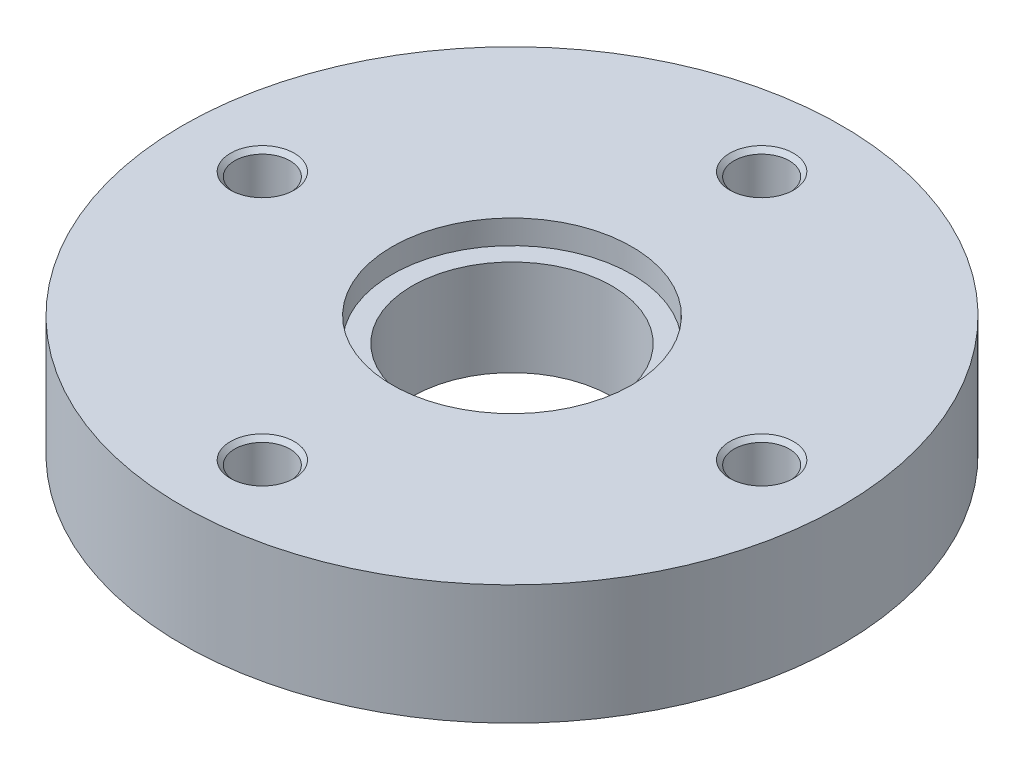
ISO-10303-21;
HEADER;
FILE_DESCRIPTION(('STEP AP214'),'2;1');
FILE_NAME('part.step','',(''),(''),'','','');
FILE_SCHEMA(('AUTOMOTIVE_DESIGN { 1 0 10303 214 1 1 1 1 }'));
ENDSEC;
DATA;
#1=APPLICATION_CONTEXT('core data for automotive mechanical design processes');
#2=APPLICATION_PROTOCOL_DEFINITION('international standard','automotive_design',2000,#1);
#3=PRODUCT_CONTEXT('',#1,'mechanical');
#4=PRODUCT('Part','Part','',(#3));
#5=PRODUCT_RELATED_PRODUCT_CATEGORY('part','',(#4));
#6=PRODUCT_DEFINITION_FORMATION('','',#4);
#7=PRODUCT_DEFINITION_CONTEXT('part definition',#1,'design');
#8=PRODUCT_DEFINITION('design','',#6,#7);
#9=PRODUCT_DEFINITION_SHAPE('','',#8);
#10=(LENGTH_UNIT() NAMED_UNIT(*) SI_UNIT(.MILLI.,.METRE.));
#11=(NAMED_UNIT(*) PLANE_ANGLE_UNIT() SI_UNIT($,.RADIAN.));
#12=(NAMED_UNIT(*) SI_UNIT($,.STERADIAN.) SOLID_ANGLE_UNIT());
#13=UNCERTAINTY_MEASURE_WITH_UNIT(LENGTH_MEASURE(1.E-05),#10,'distance_accuracy_value','');
#14=(GEOMETRIC_REPRESENTATION_CONTEXT(3) GLOBAL_UNCERTAINTY_ASSIGNED_CONTEXT((#13)) GLOBAL_UNIT_ASSIGNED_CONTEXT((#10,
#11,#12)) REPRESENTATION_CONTEXT('',''));
#15=CARTESIAN_POINT('',(0.,0.,0.));
#16=DIRECTION('',(0.,0.,1.));
#17=DIRECTION('',(1.,0.,0.));
#18=AXIS2_PLACEMENT_3D('',#15,#16,#17);
#19=CARTESIAN_POINT('',(0.,15.,0.));
#20=DIRECTION('',(0.,-1.,0.));
#21=DIRECTION('',(1.,0.,0.));
#22=AXIS2_PLACEMENT_3D('',#19,#20,#21);
#23=CYLINDRICAL_SURFACE('',#22,82.5);
#24=CARTESIAN_POINT('',(0.,0.,0.));
#25=DIRECTION('',(0.,1.,0.));
#26=DIRECTION('',(1.,0.,0.));
#27=AXIS2_PLACEMENT_3D('',#24,#25,#26);
#28=CIRCLE('',#27,82.5);
#29=CARTESIAN_POINT('',(82.5,0.,0.));
#30=VERTEX_POINT('',#29);
#31=EDGE_CURVE('E9',#30,#30,#28,.T.);
#32=ORIENTED_EDGE('',*,*,#31,.T.);
#33=EDGE_LOOP('',(#32));
#34=FACE_BOUND('',#33,.T.);
#35=CARTESIAN_POINT('',(0.,30.,0.));
#36=DIRECTION('',(0.,1.,0.));
#37=DIRECTION('',(1.,0.,0.));
#38=AXIS2_PLACEMENT_3D('',#35,#36,#37);
#39=CIRCLE('',#38,82.5);
#40=CARTESIAN_POINT('',(82.5,30.,0.));
#41=VERTEX_POINT('',#40);
#42=EDGE_CURVE('E120',#41,#41,#39,.T.);
#43=ORIENTED_EDGE('',*,*,#42,.F.);
#44=EDGE_LOOP('',(#43));
#45=FACE_BOUND('',#44,.T.);
#46=ADVANCED_FACE('F15',(#34,#45),#23,.T.);
#47=CARTESIAN_POINT('',(53.75,0.,0.));
#48=DIRECTION('',(0.,-1.,0.));
#49=DIRECTION('',(-1.,0.,0.));
#50=AXIS2_PLACEMENT_3D('',#47,#48,#49);
#51=PLANE('',#50);
#52=CARTESIAN_POINT('',(0.,0.,0.));
#53=DIRECTION('',(0.,1.,0.));
#54=DIRECTION('',(1.,0.,0.));
#55=AXIS2_PLACEMENT_3D('',#52,#53,#54);
#56=CIRCLE('',#55,25.);
#57=CARTESIAN_POINT('',(25.,0.,0.));
#58=VERTEX_POINT('',#57);
#59=EDGE_CURVE('E22',#58,#58,#56,.T.);
#60=ORIENTED_EDGE('',*,*,#59,.T.);
#61=EDGE_LOOP('',(#60));
#62=FACE_BOUND('',#61,.T.);
#63=ORIENTED_EDGE('',*,*,#31,.F.);
#64=EDGE_LOOP('',(#63));
#65=FACE_BOUND('',#64,.T.);
#66=ADVANCED_FACE('F204',(#62,#65),#51,.T.);
#67=CARTESIAN_POINT('',(0.,15.,0.));
#68=DIRECTION('',(0.,-1.,0.));
#69=DIRECTION('',(1.,0.,0.));
#70=AXIS2_PLACEMENT_3D('',#67,#68,#69);
#71=CYLINDRICAL_SURFACE('',#70,25.);
#72=ORIENTED_EDGE('',*,*,#59,.F.);
#73=EDGE_LOOP('',(#72));
#74=FACE_BOUND('',#73,.T.);
#75=CARTESIAN_POINT('',(0.,24.,0.));
#76=DIRECTION('',(0.,1.,0.));
#77=DIRECTION('',(1.,0.,0.));
#78=AXIS2_PLACEMENT_3D('',#75,#76,#77);
#79=CIRCLE('',#78,25.);
#80=CARTESIAN_POINT('',(-25.,24.,0.));
#81=VERTEX_POINT('',#80);
#82=EDGE_CURVE('E117',#81,#81,#79,.T.);
#83=ORIENTED_EDGE('',*,*,#82,.T.);
#84=EDGE_LOOP('',(#83));
#85=FACE_BOUND('',#84,.T.);
#86=ADVANCED_FACE('F118',(#74,#85),#71,.F.);
#87=CARTESIAN_POINT('',(53.75,30.,0.));
#88=DIRECTION('',(0.,1.,0.));
#89=DIRECTION('',(1.,0.,0.));
#90=AXIS2_PLACEMENT_3D('',#87,#88,#89);
#91=PLANE('',#90);
#92=ORIENTED_EDGE('',*,*,#42,.T.);
#93=EDGE_LOOP('',(#92));
#94=FACE_BOUND('',#93,.T.);
#95=CARTESIAN_POINT('',(0.,30.,0.));
#96=DIRECTION('',(0.,-1.,0.));
#97=DIRECTION('',(1.,0.,0.));
#98=AXIS2_PLACEMENT_3D('',#95,#96,#97);
#99=CIRCLE('',#98,30.);
#100=CARTESIAN_POINT('',(-30.,30.,0.));
#101=VERTEX_POINT('',#100);
#102=EDGE_CURVE('E124',#101,#101,#99,.T.);
#103=ORIENTED_EDGE('',*,*,#102,.T.);
#104=EDGE_LOOP('',(#103));
#105=FACE_BOUND('',#104,.T.);
#106=CARTESIAN_POINT('',(62.5,30.,0.));
#107=DIRECTION('',(0.,-1.,0.));
#108=DIRECTION('',(1.,0.,0.));
#109=AXIS2_PLACEMENT_3D('',#106,#107,#108);
#110=CIRCLE('',#109,8.);
#111=CARTESIAN_POINT('',(70.5,30.,0.));
#112=VERTEX_POINT('',#111);
#113=EDGE_CURVE('E136',#112,#112,#110,.T.);
#114=ORIENTED_EDGE('',*,*,#113,.T.);
#115=EDGE_LOOP('',(#114));
#116=FACE_BOUND('',#115,.T.);
#117=CARTESIAN_POINT('',(0.,30.,-62.5));
#118=DIRECTION('',(0.,-1.,0.));
#119=DIRECTION('',(0.,0.,-1.));
#120=AXIS2_PLACEMENT_3D('',#117,#118,#119);
#121=CIRCLE('',#120,8.);
#122=CARTESIAN_POINT('',(0.,30.,-70.5));
#123=VERTEX_POINT('',#122);
#124=EDGE_CURVE('E148',#123,#123,#121,.T.);
#125=ORIENTED_EDGE('',*,*,#124,.T.);
#126=EDGE_LOOP('',(#125));
#127=FACE_BOUND('',#126,.T.);
#128=CARTESIAN_POINT('',(-62.5,30.,0.));
#129=DIRECTION('',(0.,-1.,0.));
#130=DIRECTION('',(-1.,0.,0.));
#131=AXIS2_PLACEMENT_3D('',#128,#129,#130);
#132=CIRCLE('',#131,8.);
#133=CARTESIAN_POINT('',(-70.5,30.,0.));
#134=VERTEX_POINT('',#133);
#135=EDGE_CURVE('E156',#134,#134,#132,.T.);
#136=ORIENTED_EDGE('',*,*,#135,.T.);
#137=EDGE_LOOP('',(#136));
#138=FACE_BOUND('',#137,.T.);
#139=CARTESIAN_POINT('',(0.,30.,62.5));
#140=DIRECTION('',(0.,-1.,0.));
#141=DIRECTION('',(0.,0.,1.));
#142=AXIS2_PLACEMENT_3D('',#139,#140,#141);
#143=CIRCLE('',#142,8.);
#144=CARTESIAN_POINT('',(0.,30.,70.5));
#145=VERTEX_POINT('',#144);
#146=EDGE_CURVE('E166',#145,#145,#143,.T.);
#147=ORIENTED_EDGE('',*,*,#146,.T.);
#148=EDGE_LOOP('',(#147));
#149=FACE_BOUND('',#148,.T.);
#150=ADVANCED_FACE('F211',(#94,#105,#116,#127,#138,#149),#91,.T.);
#151=CARTESIAN_POINT('',(0.,24.,0.));
#152=DIRECTION('',(0.,-1.,0.));
#153=DIRECTION('',(-1.,0.,0.));
#154=AXIS2_PLACEMENT_3D('',#151,#152,#153);
#155=PLANE('',#154);
#156=CARTESIAN_POINT('',(0.,24.,0.));
#157=DIRECTION('',(0.,-1.,0.));
#158=DIRECTION('',(1.,0.,0.));
#159=AXIS2_PLACEMENT_3D('',#156,#157,#158);
#160=CIRCLE('',#159,30.);
#161=CARTESIAN_POINT('',(30.,24.,0.));
#162=VERTEX_POINT('',#161);
#163=EDGE_CURVE('E121',#162,#162,#160,.T.);
#164=ORIENTED_EDGE('',*,*,#163,.F.);
#165=EDGE_LOOP('',(#164));
#166=FACE_BOUND('',#165,.T.);
#167=ORIENTED_EDGE('',*,*,#82,.F.);
#168=EDGE_LOOP('',(#167));
#169=FACE_BOUND('',#168,.T.);
#170=ADVANCED_FACE('F198',(#166,#169),#155,.F.);
#171=CARTESIAN_POINT('',(0.,28.5,0.));
#172=DIRECTION('',(0.,-1.,0.));
#173=DIRECTION('',(1.,0.,0.));
#174=AXIS2_PLACEMENT_3D('',#171,#172,#173);
#175=CYLINDRICAL_SURFACE('',#174,30.);
#176=ORIENTED_EDGE('',*,*,#163,.T.);
#177=EDGE_LOOP('',(#176));
#178=FACE_BOUND('',#177,.T.);
#179=ORIENTED_EDGE('',*,*,#102,.F.);
#180=EDGE_LOOP('',(#179));
#181=FACE_BOUND('',#180,.T.);
#182=ADVANCED_FACE('F188',(#178,#181),#175,.F.);
#183=CARTESIAN_POINT('',(62.5,5.00308975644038,0.));
#184=DIRECTION('',(0.,1.,0.));
#185=DIRECTION('',(1.,0.,0.));
#186=AXIS2_PLACEMENT_3D('',#183,#184,#185);
#187=CONICAL_SURFACE('',#186,3.45875,1.0471975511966);
#188=CARTESIAN_POINT('',(62.5,7.,0.));
#189=DIRECTION('',(0.,-1.,0.));
#190=DIRECTION('',(1.,0.,0.));
#191=AXIS2_PLACEMENT_3D('',#188,#189,#190);
#192=CIRCLE('',#191,6.9175);
#193=CARTESIAN_POINT('',(69.4175,7.,0.));
#194=VERTEX_POINT('',#193);
#195=EDGE_CURVE('E128',#194,#194,#192,.T.);
#196=ORIENTED_EDGE('',*,*,#195,.F.);
#197=EDGE_LOOP('',(#196));
#198=FACE_BOUND('',#197,.T.);
#199=CARTESIAN_POINT('',(62.5,3.00617951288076,0.));
#200=VERTEX_POINT('',#199);
#201=VERTEX_LOOP('',#200);
#202=FACE_BOUND('',#201,.T.);
#203=ADVANCED_FACE('F185',(#198,#202),#187,.F.);
#204=CARTESIAN_POINT('',(62.5,9.95875,0.));
#205=DIRECTION('',(0.,1.,0.));
#206=DIRECTION('',(1.,0.,0.));
#207=AXIS2_PLACEMENT_3D('',#204,#205,#206);
#208=CYLINDRICAL_SURFACE('',#207,6.9175);
#209=CARTESIAN_POINT('',(62.5,12.9175,0.));
#210=DIRECTION('',(0.,-1.,0.));
#211=DIRECTION('',(1.,0.,0.));
#212=AXIS2_PLACEMENT_3D('',#209,#210,#211);
#213=CIRCLE('',#212,6.9175);
#214=CARTESIAN_POINT('',(69.4175,12.9175,0.));
#215=VERTEX_POINT('',#214);
#216=EDGE_CURVE('E129',#215,#215,#213,.T.);
#217=ORIENTED_EDGE('',*,*,#216,.F.);
#218=EDGE_LOOP('',(#217));
#219=FACE_BOUND('',#218,.T.);
#220=ORIENTED_EDGE('',*,*,#195,.T.);
#221=EDGE_LOOP('',(#220));
#222=FACE_BOUND('',#221,.T.);
#223=ADVANCED_FACE('F183',(#219,#222),#208,.F.);
#224=CARTESIAN_POINT('',(62.5,13.45875,0.));
#225=DIRECTION('',(0.,1.,0.));
#226=DIRECTION('',(1.,0.,0.));
#227=AXIS2_PLACEMENT_3D('',#224,#225,#226);
#228=CONICAL_SURFACE('',#227,7.45875,0.785398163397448);
#229=CARTESIAN_POINT('',(62.5,14.,0.));
#230=DIRECTION('',(0.,-1.,0.));
#231=DIRECTION('',(1.,0.,0.));
#232=AXIS2_PLACEMENT_3D('',#229,#230,#231);
#233=CIRCLE('',#232,8.);
#234=CARTESIAN_POINT('',(70.5,14.,0.));
#235=VERTEX_POINT('',#234);
#236=EDGE_CURVE('E131',#235,#235,#233,.T.);
#237=ORIENTED_EDGE('',*,*,#236,.F.);
#238=EDGE_LOOP('',(#237));
#239=FACE_BOUND('',#238,.T.);
#240=ORIENTED_EDGE('',*,*,#216,.T.);
#241=EDGE_LOOP('',(#240));
#242=FACE_BOUND('',#241,.T.);
#243=ADVANCED_FACE('F195',(#239,#242),#228,.F.);
#244=CARTESIAN_POINT('',(69.95875,14.,0.));
#245=DIRECTION('',(0.,1.,0.));
#246=DIRECTION('',(-1.,0.,0.));
#247=AXIS2_PLACEMENT_3D('',#244,#245,#246);
#248=PLANE('',#247);
#249=CARTESIAN_POINT('',(62.5,14.,0.));
#250=DIRECTION('',(0.,-1.,0.));
#251=DIRECTION('',(1.,0.,0.));
#252=AXIS2_PLACEMENT_3D('',#249,#250,#251);
#253=CIRCLE('',#252,6.9175);
#254=CARTESIAN_POINT('',(69.4175,14.,0.));
#255=VERTEX_POINT('',#254);
#256=EDGE_CURVE('E133',#255,#255,#253,.T.);
#257=ORIENTED_EDGE('',*,*,#256,.F.);
#258=EDGE_LOOP('',(#257));
#259=FACE_BOUND('',#258,.T.);
#260=ORIENTED_EDGE('',*,*,#236,.T.);
#261=EDGE_LOOP('',(#260));
#262=FACE_BOUND('',#261,.T.);
#263=ADVANCED_FACE('F293',(#259,#262),#248,.F.);
#264=CARTESIAN_POINT('',(62.5,21.45875,0.));
#265=DIRECTION('',(0.,1.,0.));
#266=DIRECTION('',(1.,0.,0.));
#267=AXIS2_PLACEMENT_3D('',#264,#265,#266);
#268=CYLINDRICAL_SURFACE('',#267,6.9175);
#269=CARTESIAN_POINT('',(62.5,28.9175,0.));
#270=DIRECTION('',(0.,-1.,0.));
#271=DIRECTION('',(1.,0.,0.));
#272=AXIS2_PLACEMENT_3D('',#269,#270,#271);
#273=CIRCLE('',#272,6.9175);
#274=CARTESIAN_POINT('',(69.4175,28.9175,0.));
#275=VERTEX_POINT('',#274);
#276=EDGE_CURVE('E138',#275,#275,#273,.T.);
#277=ORIENTED_EDGE('',*,*,#276,.F.);
#278=EDGE_LOOP('',(#277));
#279=FACE_BOUND('',#278,.T.);
#280=ORIENTED_EDGE('',*,*,#256,.T.);
#281=EDGE_LOOP('',(#280));
#282=FACE_BOUND('',#281,.T.);
#283=ADVANCED_FACE('F311',(#279,#282),#268,.F.);
#284=CARTESIAN_POINT('',(62.5,29.45875,0.));
#285=DIRECTION('',(0.,1.,0.));
#286=DIRECTION('',(1.,0.,0.));
#287=AXIS2_PLACEMENT_3D('',#284,#285,#286);
#288=CONICAL_SURFACE('',#287,7.45875,0.785398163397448);
#289=ORIENTED_EDGE('',*,*,#113,.F.);
#290=EDGE_LOOP('',(#289));
#291=FACE_BOUND('',#290,.T.);
#292=ORIENTED_EDGE('',*,*,#276,.T.);
#293=EDGE_LOOP('',(#292));
#294=FACE_BOUND('',#293,.T.);
#295=ADVANCED_FACE('F277',(#291,#294),#288,.F.);
#296=CARTESIAN_POINT('',(0.,5.00308975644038,-62.5));
#297=DIRECTION('',(0.,1.,0.));
#298=DIRECTION('',(0.,0.,-1.));
#299=AXIS2_PLACEMENT_3D('',#296,#297,#298);
#300=CONICAL_SURFACE('',#299,3.45875,1.0471975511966);
#301=CARTESIAN_POINT('',(0.,7.,-62.5));
#302=DIRECTION('',(0.,-1.,0.));
#303=DIRECTION('',(0.,0.,-1.));
#304=AXIS2_PLACEMENT_3D('',#301,#302,#303);
#305=CIRCLE('',#304,6.9175);
#306=CARTESIAN_POINT('',(0.,7.,-69.4175));
#307=VERTEX_POINT('',#306);
#308=EDGE_CURVE('E140',#307,#307,#305,.T.);
#309=ORIENTED_EDGE('',*,*,#308,.F.);
#310=EDGE_LOOP('',(#309));
#311=FACE_BOUND('',#310,.T.);
#312=CARTESIAN_POINT('',(0.,3.00617951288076,-62.5));
#313=VERTEX_POINT('',#312);
#314=VERTEX_LOOP('',#313);
#315=FACE_BOUND('',#314,.T.);
#316=ADVANCED_FACE('F273',(#311,#315),#300,.F.);
#317=CARTESIAN_POINT('',(0.,9.95875,-62.5));
#318=DIRECTION('',(0.,1.,0.));
#319=DIRECTION('',(0.,0.,-1.));
#320=AXIS2_PLACEMENT_3D('',#317,#318,#319);
#321=CYLINDRICAL_SURFACE('',#320,6.9175);
#322=CARTESIAN_POINT('',(0.,12.9175,-62.5));
#323=DIRECTION('',(0.,-1.,0.));
#324=DIRECTION('',(0.,0.,-1.));
#325=AXIS2_PLACEMENT_3D('',#322,#323,#324);
#326=CIRCLE('',#325,6.9175);
#327=CARTESIAN_POINT('',(0.,12.9175,-69.4175));
#328=VERTEX_POINT('',#327);
#329=EDGE_CURVE('E142',#328,#328,#326,.T.);
#330=ORIENTED_EDGE('',*,*,#329,.F.);
#331=EDGE_LOOP('',(#330));
#332=FACE_BOUND('',#331,.T.);
#333=ORIENTED_EDGE('',*,*,#308,.T.);
#334=EDGE_LOOP('',(#333));
#335=FACE_BOUND('',#334,.T.);
#336=ADVANCED_FACE('F276',(#332,#335),#321,.F.);
#337=CARTESIAN_POINT('',(0.,13.45875,-62.5));
#338=DIRECTION('',(0.,1.,0.));
#339=DIRECTION('',(0.,0.,-1.));
#340=AXIS2_PLACEMENT_3D('',#337,#338,#339);
#341=CONICAL_SURFACE('',#340,7.45875,0.785398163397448);
#342=CARTESIAN_POINT('',(0.,14.,-62.5));
#343=DIRECTION('',(0.,-1.,0.));
#344=DIRECTION('',(0.,0.,-1.));
#345=AXIS2_PLACEMENT_3D('',#342,#343,#344);
#346=CIRCLE('',#345,8.);
#347=CARTESIAN_POINT('',(0.,14.,-70.5));
#348=VERTEX_POINT('',#347);
#349=EDGE_CURVE('E144',#348,#348,#346,.T.);
#350=ORIENTED_EDGE('',*,*,#349,.F.);
#351=EDGE_LOOP('',(#350));
#352=FACE_BOUND('',#351,.T.);
#353=ORIENTED_EDGE('',*,*,#329,.T.);
#354=EDGE_LOOP('',(#353));
#355=FACE_BOUND('',#354,.T.);
#356=ADVANCED_FACE('F301',(#352,#355),#341,.F.);
#357=CARTESIAN_POINT('',(0.,14.,-69.95875));
#358=DIRECTION('',(0.,1.,0.));
#359=DIRECTION('',(0.,0.,1.));
#360=AXIS2_PLACEMENT_3D('',#357,#358,#359);
#361=PLANE('',#360);
#362=CARTESIAN_POINT('',(0.,14.,-62.5));
#363=DIRECTION('',(0.,-1.,0.));
#364=DIRECTION('',(0.,0.,-1.));
#365=AXIS2_PLACEMENT_3D('',#362,#363,#364);
#366=CIRCLE('',#365,6.9175);
#367=CARTESIAN_POINT('',(0.,14.,-69.4175));
#368=VERTEX_POINT('',#367);
#369=EDGE_CURVE('E146',#368,#368,#366,.T.);
#370=ORIENTED_EDGE('',*,*,#369,.F.);
#371=EDGE_LOOP('',(#370));
#372=FACE_BOUND('',#371,.T.);
#373=ORIENTED_EDGE('',*,*,#349,.T.);
#374=EDGE_LOOP('',(#373));
#375=FACE_BOUND('',#374,.T.);
#376=ADVANCED_FACE('F297',(#372,#375),#361,.F.);
#377=CARTESIAN_POINT('',(0.,21.45875,-62.5));
#378=DIRECTION('',(0.,1.,0.));
#379=DIRECTION('',(0.,0.,-1.));
#380=AXIS2_PLACEMENT_3D('',#377,#378,#379);
#381=CYLINDRICAL_SURFACE('',#380,6.9175);
#382=CARTESIAN_POINT('',(0.,28.9175,-62.5));
#383=DIRECTION('',(0.,-1.,0.));
#384=DIRECTION('',(0.,0.,-1.));
#385=AXIS2_PLACEMENT_3D('',#382,#383,#384);
#386=CIRCLE('',#385,6.9175);
#387=CARTESIAN_POINT('',(0.,28.9175,-69.4175));
#388=VERTEX_POINT('',#387);
#389=EDGE_CURVE('E157',#388,#388,#386,.T.);
#390=ORIENTED_EDGE('',*,*,#389,.F.);
#391=EDGE_LOOP('',(#390));
#392=FACE_BOUND('',#391,.T.);
#393=ORIENTED_EDGE('',*,*,#369,.T.);
#394=EDGE_LOOP('',(#393));
#395=FACE_BOUND('',#394,.T.);
#396=ADVANCED_FACE('F271',(#392,#395),#381,.F.);
#397=CARTESIAN_POINT('',(0.,29.45875,-62.5));
#398=DIRECTION('',(0.,1.,0.));
#399=DIRECTION('',(0.,0.,-1.));
#400=AXIS2_PLACEMENT_3D('',#397,#398,#399);
#401=CONICAL_SURFACE('',#400,7.45875,0.785398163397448);
#402=ORIENTED_EDGE('',*,*,#124,.F.);
#403=EDGE_LOOP('',(#402));
#404=FACE_BOUND('',#403,.T.);
#405=ORIENTED_EDGE('',*,*,#389,.T.);
#406=EDGE_LOOP('',(#405));
#407=FACE_BOUND('',#406,.T.);
#408=ADVANCED_FACE('F267',(#404,#407),#401,.F.);
#409=CARTESIAN_POINT('',(-62.5,5.00308975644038,0.));
#410=DIRECTION('',(0.,1.,0.));
#411=DIRECTION('',(-1.,0.,0.));
#412=AXIS2_PLACEMENT_3D('',#409,#410,#411);
#413=CONICAL_SURFACE('',#412,3.45875,1.0471975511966);
#414=CARTESIAN_POINT('',(-62.5,7.,0.));
#415=DIRECTION('',(0.,-1.,0.));
#416=DIRECTION('',(-1.,0.,0.));
#417=AXIS2_PLACEMENT_3D('',#414,#415,#416);
#418=CIRCLE('',#417,6.9175);
#419=CARTESIAN_POINT('',(-69.4175,7.,0.));
#420=VERTEX_POINT('',#419);
#421=EDGE_CURVE('E151',#420,#420,#418,.T.);
#422=ORIENTED_EDGE('',*,*,#421,.F.);
#423=EDGE_LOOP('',(#422));
#424=FACE_BOUND('',#423,.T.);
#425=CARTESIAN_POINT('',(-62.5,3.00617951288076,0.));
#426=VERTEX_POINT('',#425);
#427=VERTEX_LOOP('',#426);
#428=FACE_BOUND('',#427,.T.);
#429=ADVANCED_FACE('F270',(#424,#428),#413,.F.);
#430=CARTESIAN_POINT('',(-62.5,9.95875,0.));
#431=DIRECTION('',(0.,1.,0.));
#432=DIRECTION('',(-1.,0.,0.));
#433=AXIS2_PLACEMENT_3D('',#430,#431,#432);
#434=CYLINDRICAL_SURFACE('',#433,6.9175);
#435=CARTESIAN_POINT('',(-62.5,12.9175,0.));
#436=DIRECTION('',(0.,-1.,0.));
#437=DIRECTION('',(-1.,0.,0.));
#438=AXIS2_PLACEMENT_3D('',#435,#436,#437);
#439=CIRCLE('',#438,6.9175);
#440=CARTESIAN_POINT('',(-69.4175,12.9175,0.));
#441=VERTEX_POINT('',#440);
#442=EDGE_CURVE('E149',#441,#441,#439,.T.);
#443=ORIENTED_EDGE('',*,*,#442,.F.);
#444=EDGE_LOOP('',(#443));
#445=FACE_BOUND('',#444,.T.);
#446=ORIENTED_EDGE('',*,*,#421,.T.);
#447=EDGE_LOOP('',(#446));
#448=FACE_BOUND('',#447,.T.);
#449=ADVANCED_FACE('F289',(#445,#448),#434,.F.);
#450=CARTESIAN_POINT('',(-62.5,13.45875,0.));
#451=DIRECTION('',(0.,1.,0.));
#452=DIRECTION('',(-1.,0.,0.));
#453=AXIS2_PLACEMENT_3D('',#450,#451,#452);
#454=CONICAL_SURFACE('',#453,7.45875,0.785398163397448);
#455=CARTESIAN_POINT('',(-62.5,14.,0.));
#456=DIRECTION('',(0.,-1.,0.));
#457=DIRECTION('',(-1.,0.,0.));
#458=AXIS2_PLACEMENT_3D('',#455,#456,#457);
#459=CIRCLE('',#458,8.);
#460=CARTESIAN_POINT('',(-70.5,14.,0.));
#461=VERTEX_POINT('',#460);
#462=EDGE_CURVE('E152',#461,#461,#459,.T.);
#463=ORIENTED_EDGE('',*,*,#462,.F.);
#464=EDGE_LOOP('',(#463));
#465=FACE_BOUND('',#464,.T.);
#466=ORIENTED_EDGE('',*,*,#442,.T.);
#467=EDGE_LOOP('',(#466));
#468=FACE_BOUND('',#467,.T.);
#469=ADVANCED_FACE('F285',(#465,#468),#454,.F.);
#470=CARTESIAN_POINT('',(-69.95875,14.,0.));
#471=DIRECTION('',(0.,1.,0.));
#472=DIRECTION('',(1.,0.,0.));
#473=AXIS2_PLACEMENT_3D('',#470,#471,#472);
#474=PLANE('',#473);
#475=CARTESIAN_POINT('',(-62.5,14.,0.));
#476=DIRECTION('',(0.,-1.,0.));
#477=DIRECTION('',(-1.,0.,0.));
#478=AXIS2_PLACEMENT_3D('',#475,#476,#477);
#479=CIRCLE('',#478,6.9175);
#480=CARTESIAN_POINT('',(-69.4175,14.,0.));
#481=VERTEX_POINT('',#480);
#482=EDGE_CURVE('E154',#481,#481,#479,.T.);
#483=ORIENTED_EDGE('',*,*,#482,.F.);
#484=EDGE_LOOP('',(#483));
#485=FACE_BOUND('',#484,.T.);
#486=ORIENTED_EDGE('',*,*,#462,.T.);
#487=EDGE_LOOP('',(#486));
#488=FACE_BOUND('',#487,.T.);
#489=ADVANCED_FACE('F281',(#485,#488),#474,.F.);
#490=CARTESIAN_POINT('',(-62.5,21.45875,0.));
#491=DIRECTION('',(0.,1.,0.));
#492=DIRECTION('',(-1.,0.,0.));
#493=AXIS2_PLACEMENT_3D('',#490,#491,#492);
#494=CYLINDRICAL_SURFACE('',#493,6.9175);
#495=CARTESIAN_POINT('',(-62.5,28.9175,0.));
#496=DIRECTION('',(0.,-1.,0.));
#497=DIRECTION('',(-1.,0.,0.));
#498=AXIS2_PLACEMENT_3D('',#495,#496,#497);
#499=CIRCLE('',#498,6.9175);
#500=CARTESIAN_POINT('',(-69.4175,28.9175,0.));
#501=VERTEX_POINT('',#500);
#502=EDGE_CURVE('E167',#501,#501,#499,.T.);
#503=ORIENTED_EDGE('',*,*,#502,.F.);
#504=EDGE_LOOP('',(#503));
#505=FACE_BOUND('',#504,.T.);
#506=ORIENTED_EDGE('',*,*,#482,.T.);
#507=EDGE_LOOP('',(#506));
#508=FACE_BOUND('',#507,.T.);
#509=ADVANCED_FACE('F263',(#505,#508),#494,.F.);
#510=CARTESIAN_POINT('',(-62.5,29.45875,0.));
#511=DIRECTION('',(0.,1.,0.));
#512=DIRECTION('',(-1.,0.,0.));
#513=AXIS2_PLACEMENT_3D('',#510,#511,#512);
#514=CONICAL_SURFACE('',#513,7.45875,0.785398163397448);
#515=ORIENTED_EDGE('',*,*,#135,.F.);
#516=EDGE_LOOP('',(#515));
#517=FACE_BOUND('',#516,.T.);
#518=ORIENTED_EDGE('',*,*,#502,.T.);
#519=EDGE_LOOP('',(#518));
#520=FACE_BOUND('',#519,.T.);
#521=ADVANCED_FACE('F259',(#517,#520),#514,.F.);
#522=CARTESIAN_POINT('',(0.,5.00308975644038,62.5));
#523=DIRECTION('',(0.,1.,0.));
#524=DIRECTION('',(0.,0.,1.));
#525=AXIS2_PLACEMENT_3D('',#522,#523,#524);
#526=CONICAL_SURFACE('',#525,3.45875,1.0471975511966);
#527=CARTESIAN_POINT('',(0.,7.,62.5));
#528=DIRECTION('',(0.,-1.,0.));
#529=DIRECTION('',(0.,0.,1.));
#530=AXIS2_PLACEMENT_3D('',#527,#528,#529);
#531=CIRCLE('',#530,6.9175);
#532=CARTESIAN_POINT('',(0.,7.,69.4175));
#533=VERTEX_POINT('',#532);
#534=EDGE_CURVE('E161',#533,#533,#531,.T.);
#535=ORIENTED_EDGE('',*,*,#534,.F.);
#536=EDGE_LOOP('',(#535));
#537=FACE_BOUND('',#536,.T.);
#538=CARTESIAN_POINT('',(0.,3.00617951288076,62.5));
#539=VERTEX_POINT('',#538);
#540=VERTEX_LOOP('',#539);
#541=FACE_BOUND('',#540,.T.);
#542=ADVANCED_FACE('F252',(#537,#541),#526,.F.);
#543=CARTESIAN_POINT('',(0.,9.95875,62.5));
#544=DIRECTION('',(0.,1.,0.));
#545=DIRECTION('',(0.,0.,1.));
#546=AXIS2_PLACEMENT_3D('',#543,#544,#545);
#547=CYLINDRICAL_SURFACE('',#546,6.9175);
#548=CARTESIAN_POINT('',(0.,12.9175,62.5));
#549=DIRECTION('',(0.,-1.,0.));
#550=DIRECTION('',(0.,0.,1.));
#551=AXIS2_PLACEMENT_3D('',#548,#549,#550);
#552=CIRCLE('',#551,6.9175);
#553=CARTESIAN_POINT('',(0.,12.9175,69.4175));
#554=VERTEX_POINT('',#553);
#555=EDGE_CURVE('E159',#554,#554,#552,.T.);
#556=ORIENTED_EDGE('',*,*,#555,.F.);
#557=EDGE_LOOP('',(#556));
#558=FACE_BOUND('',#557,.T.);
#559=ORIENTED_EDGE('',*,*,#534,.T.);
#560=EDGE_LOOP('',(#559));
#561=FACE_BOUND('',#560,.T.);
#562=ADVANCED_FACE('F247',(#558,#561),#547,.F.);
#563=CARTESIAN_POINT('',(0.,13.45875,62.5));
#564=DIRECTION('',(0.,1.,0.));
#565=DIRECTION('',(0.,0.,1.));
#566=AXIS2_PLACEMENT_3D('',#563,#564,#565);
#567=CONICAL_SURFACE('',#566,7.45875,0.785398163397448);
#568=CARTESIAN_POINT('',(0.,14.,62.5));
#569=DIRECTION('',(0.,-1.,0.));
#570=DIRECTION('',(0.,0.,1.));
#571=AXIS2_PLACEMENT_3D('',#568,#569,#570);
#572=CIRCLE('',#571,8.);
#573=CARTESIAN_POINT('',(0.,14.,70.5));
#574=VERTEX_POINT('',#573);
#575=EDGE_CURVE('E162',#574,#574,#572,.T.);
#576=ORIENTED_EDGE('',*,*,#575,.F.);
#577=EDGE_LOOP('',(#576));
#578=FACE_BOUND('',#577,.T.);
#579=ORIENTED_EDGE('',*,*,#555,.T.);
#580=EDGE_LOOP('',(#579));
#581=FACE_BOUND('',#580,.T.);
#582=ADVANCED_FACE('F241',(#578,#581),#567,.F.);
#583=CARTESIAN_POINT('',(0.,14.,69.95875));
#584=DIRECTION('',(0.,1.,0.));
#585=DIRECTION('',(0.,0.,-1.));
#586=AXIS2_PLACEMENT_3D('',#583,#584,#585);
#587=PLANE('',#586);
#588=CARTESIAN_POINT('',(0.,14.,62.5));
#589=DIRECTION('',(0.,-1.,0.));
#590=DIRECTION('',(0.,0.,1.));
#591=AXIS2_PLACEMENT_3D('',#588,#589,#590);
#592=CIRCLE('',#591,6.9175);
#593=CARTESIAN_POINT('',(0.,14.,69.4175));
#594=VERTEX_POINT('',#593);
#595=EDGE_CURVE('E164',#594,#594,#592,.T.);
#596=ORIENTED_EDGE('',*,*,#595,.F.);
#597=EDGE_LOOP('',(#596));
#598=FACE_BOUND('',#597,.T.);
#599=ORIENTED_EDGE('',*,*,#575,.T.);
#600=EDGE_LOOP('',(#599));
#601=FACE_BOUND('',#600,.T.);
#602=ADVANCED_FACE('F235',(#598,#601),#587,.F.);
#603=CARTESIAN_POINT('',(0.,21.45875,62.5));
#604=DIRECTION('',(0.,1.,0.));
#605=DIRECTION('',(0.,0.,1.));
#606=AXIS2_PLACEMENT_3D('',#603,#604,#605);
#607=CYLINDRICAL_SURFACE('',#606,6.9175);
#608=CARTESIAN_POINT('',(0.,28.9175,62.5));
#609=DIRECTION('',(0.,-1.,0.));
#610=DIRECTION('',(0.,0.,1.));
#611=AXIS2_PLACEMENT_3D('',#608,#609,#610);
#612=CIRCLE('',#611,6.9175);
#613=CARTESIAN_POINT('',(0.,28.9175,69.4175));
#614=VERTEX_POINT('',#613);
#615=EDGE_CURVE('E174',#614,#614,#612,.T.);
#616=ORIENTED_EDGE('',*,*,#615,.F.);
#617=EDGE_LOOP('',(#616));
#618=FACE_BOUND('',#617,.T.);
#619=ORIENTED_EDGE('',*,*,#595,.T.);
#620=EDGE_LOOP('',(#619));
#621=FACE_BOUND('',#620,.T.);
#622=ADVANCED_FACE('F228',(#618,#621),#607,.F.);
#623=CARTESIAN_POINT('',(0.,29.45875,62.5));
#624=DIRECTION('',(0.,1.,0.));
#625=DIRECTION('',(0.,0.,1.));
#626=AXIS2_PLACEMENT_3D('',#623,#624,#625);
#627=CONICAL_SURFACE('',#626,7.45875,0.785398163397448);
#628=ORIENTED_EDGE('',*,*,#146,.F.);
#629=EDGE_LOOP('',(#628));
#630=FACE_BOUND('',#629,.T.);
#631=ORIENTED_EDGE('',*,*,#615,.T.);
#632=EDGE_LOOP('',(#631));
#633=FACE_BOUND('',#632,.T.);
#634=ADVANCED_FACE('F225',(#630,#633),#627,.F.);
#635=CLOSED_SHELL('',(#46,#66,#86,#150,#170,#182,#203,#223,#243,#263,#283,#295,#316,#336,#356,
#376,#396,#408,#429,#449,#469,#489,#509,#521,#542,#562,#582,#602,#622,#634));
#636=MANIFOLD_SOLID_BREP('B1',#635);
#637=ADVANCED_BREP_SHAPE_REPRESENTATION('',(#18,#636),#14);
#638=SHAPE_DEFINITION_REPRESENTATION(#9,#637);
ENDSEC;
END-ISO-10303-21;
